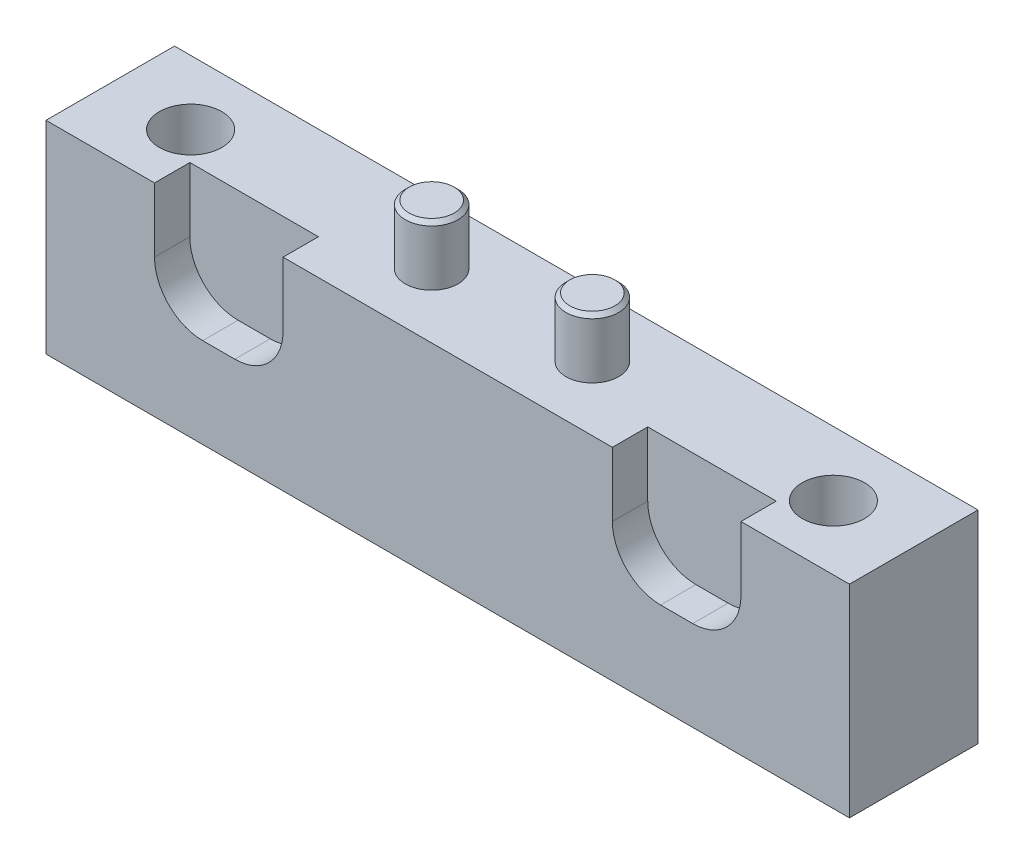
ISO-10303-21;
HEADER;
FILE_DESCRIPTION(('STEP AP214'),'2;1');
FILE_NAME('part.step','',(''),(''),'','','');
FILE_SCHEMA(('AUTOMOTIVE_DESIGN { 1 0 10303 214 1 1 1 1 }'));
ENDSEC;
DATA;
#1=APPLICATION_CONTEXT('core data for automotive mechanical design processes');
#2=APPLICATION_PROTOCOL_DEFINITION('international standard','automotive_design',2000,#1);
#3=PRODUCT_CONTEXT('',#1,'mechanical');
#4=PRODUCT('Part','Part','',(#3));
#5=PRODUCT_RELATED_PRODUCT_CATEGORY('part','',(#4));
#6=PRODUCT_DEFINITION_FORMATION('','',#4);
#7=PRODUCT_DEFINITION_CONTEXT('part definition',#1,'design');
#8=PRODUCT_DEFINITION('design','',#6,#7);
#9=PRODUCT_DEFINITION_SHAPE('','',#8);
#10=(LENGTH_UNIT() NAMED_UNIT(*) SI_UNIT(.MILLI.,.METRE.));
#11=(NAMED_UNIT(*) PLANE_ANGLE_UNIT() SI_UNIT($,.RADIAN.));
#12=(NAMED_UNIT(*) SI_UNIT($,.STERADIAN.) SOLID_ANGLE_UNIT());
#13=UNCERTAINTY_MEASURE_WITH_UNIT(LENGTH_MEASURE(1.E-05),#10,'distance_accuracy_value','');
#14=(GEOMETRIC_REPRESENTATION_CONTEXT(3) GLOBAL_UNCERTAINTY_ASSIGNED_CONTEXT((#13)) GLOBAL_UNIT_ASSIGNED_CONTEXT((#10,
#11,#12)) REPRESENTATION_CONTEXT('',''));
#15=CARTESIAN_POINT('',(0.,0.,0.));
#16=DIRECTION('',(0.,0.,1.));
#17=DIRECTION('',(1.,0.,0.));
#18=AXIS2_PLACEMENT_3D('',#15,#16,#17);
#19=CARTESIAN_POINT('',(-6.35,-15.3416,0.));
#20=DIRECTION('',(0.,1.,0.));
#21=DIRECTION('',(0.5,0.,-0.86602540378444));
#22=AXIS2_PLACEMENT_3D('',#19,#20,#21);
#23=CONICAL_SURFACE('',#22,3.0734,0.785398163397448);
#24=CARTESIAN_POINT('',(-6.35,-14.986,0.));
#25=DIRECTION('',(0.,-1.,0.));
#26=DIRECTION('',(-0.5,0.,0.86602540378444));
#27=AXIS2_PLACEMENT_3D('',#24,#25,#26);
#28=CIRCLE('',#27,3.429);
#29=CARTESIAN_POINT('',(-8.0645,-14.986,2.96960110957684));
#30=VERTEX_POINT('',#29);
#31=EDGE_CURVE('E359',#30,#30,#28,.T.);
#32=ORIENTED_EDGE('',*,*,#31,.T.);
#33=EDGE_LOOP('',(#32));
#34=FACE_BOUND('',#33,.T.);
#35=CARTESIAN_POINT('',(-6.35,-15.3416,0.));
#36=DIRECTION('',(0.,-1.,0.));
#37=DIRECTION('',(-0.5,0.,0.86602540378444));
#38=AXIS2_PLACEMENT_3D('',#35,#36,#37);
#39=CIRCLE('',#38,3.0734);
#40=CARTESIAN_POINT('',(-7.8867,-15.3416,2.66164247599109));
#41=VERTEX_POINT('',#40);
#42=EDGE_CURVE('E362',#41,#41,#39,.T.);
#43=ORIENTED_EDGE('',*,*,#42,.F.);
#44=EDGE_LOOP('',(#43));
#45=FACE_BOUND('',#44,.T.);
#46=ADVANCED_FACE('F16',(#34,#45),#23,.T.);
#47=CARTESIAN_POINT('',(-6.35,-47.0916,0.));
#48=DIRECTION('',(0.,-1.,0.));
#49=DIRECTION('',(-0.5,0.,0.86602540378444));
#50=AXIS2_PLACEMENT_3D('',#47,#48,#49);
#51=CYLINDRICAL_SURFACE('',#50,3.429);
#52=CARTESIAN_POINT('',(-6.35,-11.176,0.));
#53=DIRECTION('',(0.,-1.,0.));
#54=DIRECTION('',(-0.5,0.,0.86602540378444));
#55=AXIS2_PLACEMENT_3D('',#52,#53,#54);
#56=CIRCLE('',#55,3.429);
#57=CARTESIAN_POINT('',(-8.0645,-11.176,2.96960110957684));
#58=VERTEX_POINT('',#57);
#59=EDGE_CURVE('E356',#58,#58,#56,.T.);
#60=ORIENTED_EDGE('',*,*,#59,.T.);
#61=EDGE_LOOP('',(#60));
#62=FACE_BOUND('',#61,.T.);
#63=ORIENTED_EDGE('',*,*,#31,.F.);
#64=EDGE_LOOP('',(#63));
#65=FACE_BOUND('',#64,.T.);
#66=ADVANCED_FACE('F519',(#62,#65),#51,.T.);
#67=CARTESIAN_POINT('',(-6.35,-10.7188,2.06185637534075));
#68=DIRECTION('',(-0.5,0.,0.866025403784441));
#69=DIRECTION('',(0.866025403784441,0.,0.5));
#70=AXIS2_PLACEMENT_3D('',#67,#68,#69);
#71=PLANE('',#70);
#72=DIRECTION('',(-0.866025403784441,0.,-0.5));
#73=VECTOR('',#72,1.);
#74=CARTESIAN_POINT('',(-6.35,-11.176,2.06185637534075));
#75=LINE('',#74,#73);
#76=CARTESIAN_POINT('',(-6.35,-11.176,2.06185637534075));
#77=VERTEX_POINT('',#76);
#78=CARTESIAN_POINT('',(-8.13562,-11.176,1.03092818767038));
#79=VERTEX_POINT('',#78);
#80=EDGE_CURVE('E326',#77,#79,#75,.T.);
#81=ORIENTED_EDGE('',*,*,#80,.F.);
#82=DIRECTION('',(0.,-1.,0.));
#83=VECTOR('',#82,1.);
#84=CARTESIAN_POINT('',(-6.35,-10.7188,2.06185637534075));
#85=LINE('',#84,#83);
#86=CARTESIAN_POINT('',(-6.35,-15.3416,2.06185637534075));
#87=VERTEX_POINT('',#86);
#88=EDGE_CURVE('E345',#77,#87,#85,.T.);
#89=ORIENTED_EDGE('',*,*,#88,.T.);
#90=DIRECTION('',(-0.866025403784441,0.,-0.5));
#91=VECTOR('',#90,1.);
#92=CARTESIAN_POINT('',(-6.35,-15.3416,2.06185637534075));
#93=LINE('',#92,#91);
#94=CARTESIAN_POINT('',(-8.13562,-15.3416,1.03092818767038));
#95=VERTEX_POINT('',#94);
#96=EDGE_CURVE('E341',#87,#95,#93,.T.);
#97=ORIENTED_EDGE('',*,*,#96,.T.);
#98=DIRECTION('',(0.,-1.,0.));
#99=VECTOR('',#98,1.);
#100=CARTESIAN_POINT('',(-8.13562,-10.7188,1.03092818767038));
#101=LINE('',#100,#99);
#102=EDGE_CURVE('E338',#79,#95,#101,.T.);
#103=ORIENTED_EDGE('',*,*,#102,.F.);
#104=EDGE_LOOP('',(#81,#89,#97,#103));
#105=FACE_BOUND('',#104,.T.);
#106=ADVANCED_FACE('F339',(#105),#71,.F.);
#107=CARTESIAN_POINT('',(-6.35,-10.7188,2.06185637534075));
#108=DIRECTION('',(-0.5,0.,-0.866025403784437));
#109=DIRECTION('',(-0.866025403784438,0.,0.5));
#110=AXIS2_PLACEMENT_3D('',#107,#108,#109);
#111=PLANE('',#110);
#112=ORIENTED_EDGE('',*,*,#88,.F.);
#113=DIRECTION('',(0.866025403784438,0.,-0.5));
#114=VECTOR('',#113,1.);
#115=CARTESIAN_POINT('',(-6.35,-11.176,2.06185637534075));
#116=LINE('',#115,#114);
#117=CARTESIAN_POINT('',(-4.56438,-11.176,1.03092818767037));
#118=VERTEX_POINT('',#117);
#119=EDGE_CURVE('E324',#77,#118,#116,.T.);
#120=ORIENTED_EDGE('',*,*,#119,.T.);
#121=DIRECTION('',(0.,-1.,0.));
#122=VECTOR('',#121,1.);
#123=CARTESIAN_POINT('',(-4.56438,-10.7188,1.03092818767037));
#124=LINE('',#123,#122);
#125=CARTESIAN_POINT('',(-4.56438,-15.3416,1.03092818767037));
#126=VERTEX_POINT('',#125);
#127=EDGE_CURVE('E350',#118,#126,#124,.T.);
#128=ORIENTED_EDGE('',*,*,#127,.T.);
#129=DIRECTION('',(0.866025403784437,0.,-0.5));
#130=VECTOR('',#129,1.);
#131=CARTESIAN_POINT('',(-6.35,-15.3416,2.06185637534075));
#132=LINE('',#131,#130);
#133=EDGE_CURVE('E1078',#87,#126,#132,.T.);
#134=ORIENTED_EDGE('',*,*,#133,.F.);
#135=EDGE_LOOP('',(#112,#120,#128,#134));
#136=FACE_BOUND('',#135,.T.);
#137=ADVANCED_FACE('F1008',(#136),#111,.T.);
#138=CARTESIAN_POINT('',(-4.56438,-10.7188,1.03092818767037));
#139=DIRECTION('',(-1.,0.,0.));
#140=DIRECTION('',(0.,0.,1.));
#141=AXIS2_PLACEMENT_3D('',#138,#139,#140);
#142=PLANE('',#141);
#143=ORIENTED_EDGE('',*,*,#127,.F.);
#144=DIRECTION('',(0.,0.,-1.));
#145=VECTOR('',#144,1.);
#146=CARTESIAN_POINT('',(-4.56438,-11.176,1.03092818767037));
#147=LINE('',#146,#145);
#148=CARTESIAN_POINT('',(-4.56438,-11.176,-1.03092818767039));
#149=VERTEX_POINT('',#148);
#150=EDGE_CURVE('E320',#118,#149,#147,.T.);
#151=ORIENTED_EDGE('',*,*,#150,.T.);
#152=DIRECTION('',(0.,-1.,0.));
#153=VECTOR('',#152,1.);
#154=CARTESIAN_POINT('',(-4.56438,-10.7188,-1.03092818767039));
#155=LINE('',#154,#153);
#156=CARTESIAN_POINT('',(-4.56438,-15.3416,-1.03092818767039));
#157=VERTEX_POINT('',#156);
#158=EDGE_CURVE('E1101',#149,#157,#155,.T.);
#159=ORIENTED_EDGE('',*,*,#158,.T.);
#160=DIRECTION('',(0.,0.,-1.));
#161=VECTOR('',#160,1.);
#162=CARTESIAN_POINT('',(-4.56438,-15.3416,1.03092818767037));
#163=LINE('',#162,#161);
#164=EDGE_CURVE('E1117',#126,#157,#163,.T.);
#165=ORIENTED_EDGE('',*,*,#164,.F.);
#166=EDGE_LOOP('',(#143,#151,#159,#165));
#167=FACE_BOUND('',#166,.T.);
#168=ADVANCED_FACE('F997',(#167),#142,.T.);
#169=CARTESIAN_POINT('',(-6.35,-10.7188,-2.06185637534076));
#170=DIRECTION('',(0.5,0.,-0.866025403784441));
#171=DIRECTION('',(-0.866025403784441,0.,-0.5));
#172=AXIS2_PLACEMENT_3D('',#169,#170,#171);
#173=PLANE('',#172);
#174=DIRECTION('',(0.866025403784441,0.,0.5));
#175=VECTOR('',#174,1.);
#176=CARTESIAN_POINT('',(-6.35,-11.176,-2.06185637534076));
#177=LINE('',#176,#175);
#178=CARTESIAN_POINT('',(-6.35,-11.176,-2.06185637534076));
#179=VERTEX_POINT('',#178);
#180=EDGE_CURVE('E317',#179,#149,#177,.T.);
#181=ORIENTED_EDGE('',*,*,#180,.F.);
#182=DIRECTION('',(0.,-1.,0.));
#183=VECTOR('',#182,1.);
#184=CARTESIAN_POINT('',(-6.35,-10.7188,-2.06185637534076));
#185=LINE('',#184,#183);
#186=CARTESIAN_POINT('',(-6.35,-15.3416,-2.06185637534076));
#187=VERTEX_POINT('',#186);
#188=EDGE_CURVE('E1107',#179,#187,#185,.T.);
#189=ORIENTED_EDGE('',*,*,#188,.T.);
#190=DIRECTION('',(0.866025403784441,0.,0.5));
#191=VECTOR('',#190,1.);
#192=CARTESIAN_POINT('',(-6.35,-15.3416,-2.06185637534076));
#193=LINE('',#192,#191);
#194=EDGE_CURVE('E1105',#187,#157,#193,.T.);
#195=ORIENTED_EDGE('',*,*,#194,.T.);
#196=ORIENTED_EDGE('',*,*,#158,.F.);
#197=EDGE_LOOP('',(#181,#189,#195,#196));
#198=FACE_BOUND('',#197,.T.);
#199=ADVANCED_FACE('F534',(#198),#173,.F.);
#200=CARTESIAN_POINT('',(-6.35,-15.3416,0.));
#201=DIRECTION('',(0.,-1.,0.));
#202=DIRECTION('',(-0.5,0.,0.86602540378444));
#203=AXIS2_PLACEMENT_3D('',#200,#201,#202);
#204=PLANE('',#203);
#205=ORIENTED_EDGE('',*,*,#42,.T.);
#206=EDGE_LOOP('',(#205));
#207=FACE_BOUND('',#206,.T.);
#208=DIRECTION('',(0.866025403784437,0.,-0.5));
#209=VECTOR('',#208,1.);
#210=CARTESIAN_POINT('',(-8.13562,-15.3416,-1.03092818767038));
#211=LINE('',#210,#209);
#212=CARTESIAN_POINT('',(-8.13562,-15.3416,-1.03092818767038));
#213=VERTEX_POINT('',#212);
#214=EDGE_CURVE('E1113',#213,#187,#211,.T.);
#215=ORIENTED_EDGE('',*,*,#214,.F.);
#216=DIRECTION('',(0.,0.,1.));
#217=VECTOR('',#216,1.);
#218=CARTESIAN_POINT('',(-8.13562,-15.3416,-1.03092818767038));
#219=LINE('',#218,#217);
#220=EDGE_CURVE('E413',#213,#95,#219,.T.);
#221=ORIENTED_EDGE('',*,*,#220,.T.);
#222=ORIENTED_EDGE('',*,*,#96,.F.);
#223=ORIENTED_EDGE('',*,*,#133,.T.);
#224=ORIENTED_EDGE('',*,*,#164,.T.);
#225=ORIENTED_EDGE('',*,*,#194,.F.);
#226=EDGE_LOOP('',(#215,#221,#222,#223,#224,#225));
#227=FACE_BOUND('',#226,.T.);
#228=ADVANCED_FACE('F531',(#207,#227),#204,.T.);
#229=CARTESIAN_POINT('',(-8.13562,-10.7188,-1.03092818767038));
#230=DIRECTION('',(1.,0.,0.));
#231=DIRECTION('',(0.,0.,-1.));
#232=AXIS2_PLACEMENT_3D('',#229,#230,#231);
#233=PLANE('',#232);
#234=DIRECTION('',(0.,-1.,0.));
#235=VECTOR('',#234,1.);
#236=CARTESIAN_POINT('',(-8.13562,-10.7188,-1.03092818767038));
#237=LINE('',#236,#235);
#238=CARTESIAN_POINT('',(-8.13562,-11.176,-1.03092818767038));
#239=VERTEX_POINT('',#238);
#240=EDGE_CURVE('E1109',#239,#213,#237,.T.);
#241=ORIENTED_EDGE('',*,*,#240,.F.);
#242=DIRECTION('',(0.,0.,1.));
#243=VECTOR('',#242,1.);
#244=CARTESIAN_POINT('',(-8.13562,-11.176,-1.03092818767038));
#245=LINE('',#244,#243);
#246=EDGE_CURVE('E20',#239,#79,#245,.T.);
#247=ORIENTED_EDGE('',*,*,#246,.T.);
#248=ORIENTED_EDGE('',*,*,#102,.T.);
#249=ORIENTED_EDGE('',*,*,#220,.F.);
#250=EDGE_LOOP('',(#241,#247,#248,#249));
#251=FACE_BOUND('',#250,.T.);
#252=ADVANCED_FACE('F509',(#251),#233,.T.);
#253=CARTESIAN_POINT('',(-8.13562,-10.7188,-1.03092818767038));
#254=DIRECTION('',(-0.5,0.,-0.866025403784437));
#255=DIRECTION('',(-0.866025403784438,0.,0.5));
#256=AXIS2_PLACEMENT_3D('',#253,#254,#255);
#257=PLANE('',#256);
#258=DIRECTION('',(0.866025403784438,0.,-0.5));
#259=VECTOR('',#258,1.);
#260=CARTESIAN_POINT('',(-8.13562,-11.176,-1.03092818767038));
#261=LINE('',#260,#259);
#262=EDGE_CURVE('E321',#239,#179,#261,.T.);
#263=ORIENTED_EDGE('',*,*,#262,.F.);
#264=ORIENTED_EDGE('',*,*,#240,.T.);
#265=ORIENTED_EDGE('',*,*,#214,.T.);
#266=ORIENTED_EDGE('',*,*,#188,.F.);
#267=EDGE_LOOP('',(#263,#264,#265,#266));
#268=FACE_BOUND('',#267,.T.);
#269=ADVANCED_FACE('F497',(#268),#257,.F.);
#270=CARTESIAN_POINT('',(-3.8862,-11.176,0.));
#271=DIRECTION('',(0.,1.,0.));
#272=DIRECTION('',(0.,0.,1.));
#273=AXIS2_PLACEMENT_3D('',#270,#271,#272);
#274=PLANE('',#273);
#275=ORIENTED_EDGE('',*,*,#246,.F.);
#276=ORIENTED_EDGE('',*,*,#262,.T.);
#277=ORIENTED_EDGE('',*,*,#180,.T.);
#278=ORIENTED_EDGE('',*,*,#150,.F.);
#279=ORIENTED_EDGE('',*,*,#119,.F.);
#280=ORIENTED_EDGE('',*,*,#80,.T.);
#281=EDGE_LOOP('',(#275,#276,#277,#278,#279,#280));
#282=FACE_BOUND('',#281,.T.);
#283=ADVANCED_FACE('F330',(#282),#274,.F.);
#284=CARTESIAN_POINT('',(8.8138,-11.176,0.));
#285=DIRECTION('',(0.,1.,0.));
#286=DIRECTION('',(0.,0.,1.));
#287=AXIS2_PLACEMENT_3D('',#284,#285,#286);
#288=PLANE('',#287);
#289=DIRECTION('',(0.,0.,1.));
#290=VECTOR('',#289,1.);
#291=CARTESIAN_POINT('',(4.56438,-11.176,-1.03092818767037));
#292=LINE('',#291,#290);
#293=CARTESIAN_POINT('',(4.56438,-11.176,-1.03092818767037));
#294=VERTEX_POINT('',#293);
#295=CARTESIAN_POINT('',(4.56438,-11.176,1.03092818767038));
#296=VERTEX_POINT('',#295);
#297=EDGE_CURVE('E314',#294,#296,#292,.T.);
#298=ORIENTED_EDGE('',*,*,#297,.F.);
#299=DIRECTION('',(0.866025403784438,0.,-0.5));
#300=VECTOR('',#299,1.);
#301=CARTESIAN_POINT('',(4.56438,-11.176,-1.03092818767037));
#302=LINE('',#301,#300);
#303=CARTESIAN_POINT('',(6.35,-11.176,-2.06185637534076));
#304=VERTEX_POINT('',#303);
#305=EDGE_CURVE('E305',#294,#304,#302,.T.);
#306=ORIENTED_EDGE('',*,*,#305,.T.);
#307=DIRECTION('',(0.866025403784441,0.,0.5));
#308=VECTOR('',#307,1.);
#309=CARTESIAN_POINT('',(6.35,-11.176,-2.06185637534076));
#310=LINE('',#309,#308);
#311=CARTESIAN_POINT('',(8.13562,-11.176,-1.03092818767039));
#312=VERTEX_POINT('',#311);
#313=EDGE_CURVE('E302',#304,#312,#310,.T.);
#314=ORIENTED_EDGE('',*,*,#313,.T.);
#315=DIRECTION('',(0.,0.,-1.));
#316=VECTOR('',#315,1.);
#317=CARTESIAN_POINT('',(8.13562,-11.176,1.03092818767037));
#318=LINE('',#317,#316);
#319=CARTESIAN_POINT('',(8.13562,-11.176,1.03092818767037));
#320=VERTEX_POINT('',#319);
#321=EDGE_CURVE('E304',#320,#312,#318,.T.);
#322=ORIENTED_EDGE('',*,*,#321,.F.);
#323=DIRECTION('',(0.866025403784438,0.,-0.5));
#324=VECTOR('',#323,1.);
#325=CARTESIAN_POINT('',(6.35,-11.176,2.06185637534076));
#326=LINE('',#325,#324);
#327=CARTESIAN_POINT('',(6.35,-11.176,2.06185637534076));
#328=VERTEX_POINT('',#327);
#329=EDGE_CURVE('E308',#328,#320,#326,.T.);
#330=ORIENTED_EDGE('',*,*,#329,.F.);
#331=DIRECTION('',(-0.866025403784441,0.,-0.5));
#332=VECTOR('',#331,1.);
#333=CARTESIAN_POINT('',(6.35,-11.176,2.06185637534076));
#334=LINE('',#333,#332);
#335=EDGE_CURVE('E311',#328,#296,#334,.T.);
#336=ORIENTED_EDGE('',*,*,#335,.T.);
#337=EDGE_LOOP('',(#298,#306,#314,#322,#330,#336));
#338=FACE_BOUND('',#337,.T.);
#339=ADVANCED_FACE('F496',(#338),#288,.F.);
#340=CARTESIAN_POINT('',(6.35,-10.7188,-2.06185637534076));
#341=DIRECTION('',(0.5,0.,-0.866025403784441));
#342=DIRECTION('',(-0.866025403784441,0.,-0.5));
#343=AXIS2_PLACEMENT_3D('',#340,#341,#342);
#344=PLANE('',#343);
#345=ORIENTED_EDGE('',*,*,#313,.F.);
#346=DIRECTION('',(0.,-1.,0.));
#347=VECTOR('',#346,1.);
#348=CARTESIAN_POINT('',(6.35,-10.7188,-2.06185637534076));
#349=LINE('',#348,#347);
#350=CARTESIAN_POINT('',(6.35,-15.3416,-2.06185637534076));
#351=VERTEX_POINT('',#350);
#352=EDGE_CURVE('E385',#304,#351,#349,.T.);
#353=ORIENTED_EDGE('',*,*,#352,.T.);
#354=DIRECTION('',(0.866025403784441,0.,0.5));
#355=VECTOR('',#354,1.);
#356=CARTESIAN_POINT('',(6.35,-15.3416,-2.06185637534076));
#357=LINE('',#356,#355);
#358=CARTESIAN_POINT('',(8.13562,-15.3416,-1.03092818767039));
#359=VERTEX_POINT('',#358);
#360=EDGE_CURVE('E377',#351,#359,#357,.T.);
#361=ORIENTED_EDGE('',*,*,#360,.T.);
#362=DIRECTION('',(0.,-1.,0.));
#363=VECTOR('',#362,1.);
#364=CARTESIAN_POINT('',(8.13562,-10.7188,-1.03092818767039));
#365=LINE('',#364,#363);
#366=EDGE_CURVE('E387',#312,#359,#365,.T.);
#367=ORIENTED_EDGE('',*,*,#366,.F.);
#368=EDGE_LOOP('',(#345,#353,#361,#367));
#369=FACE_BOUND('',#368,.T.);
#370=ADVANCED_FACE('F505',(#369),#344,.F.);
#371=CARTESIAN_POINT('',(8.13562,-10.7188,1.03092818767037));
#372=DIRECTION('',(-1.,0.,0.));
#373=DIRECTION('',(0.,0.,1.));
#374=AXIS2_PLACEMENT_3D('',#371,#372,#373);
#375=PLANE('',#374);
#376=DIRECTION('',(0.,-1.,0.));
#377=VECTOR('',#376,1.);
#378=CARTESIAN_POINT('',(8.13562,-10.7188,1.03092818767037));
#379=LINE('',#378,#377);
#380=CARTESIAN_POINT('',(8.13562,-15.3416,1.03092818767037));
#381=VERTEX_POINT('',#380);
#382=EDGE_CURVE('E389',#320,#381,#379,.T.);
#383=ORIENTED_EDGE('',*,*,#382,.F.);
#384=ORIENTED_EDGE('',*,*,#321,.T.);
#385=ORIENTED_EDGE('',*,*,#366,.T.);
#386=DIRECTION('',(0.,0.,-1.));
#387=VECTOR('',#386,1.);
#388=CARTESIAN_POINT('',(8.13562,-15.3416,1.03092818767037));
#389=LINE('',#388,#387);
#390=EDGE_CURVE('E374',#381,#359,#389,.T.);
#391=ORIENTED_EDGE('',*,*,#390,.F.);
#392=EDGE_LOOP('',(#383,#384,#385,#391));
#393=FACE_BOUND('',#392,.T.);
#394=ADVANCED_FACE('F544',(#393),#375,.T.);
#395=CARTESIAN_POINT('',(6.35,-10.7188,2.06185637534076));
#396=DIRECTION('',(-0.5,0.,-0.866025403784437));
#397=DIRECTION('',(-0.866025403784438,0.,0.5));
#398=AXIS2_PLACEMENT_3D('',#395,#396,#397);
#399=PLANE('',#398);
#400=DIRECTION('',(0.,-1.,0.));
#401=VECTOR('',#400,1.);
#402=CARTESIAN_POINT('',(6.35,-10.7188,2.06185637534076));
#403=LINE('',#402,#401);
#404=CARTESIAN_POINT('',(6.35,-15.3416,2.06185637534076));
#405=VERTEX_POINT('',#404);
#406=EDGE_CURVE('E391',#328,#405,#403,.T.);
#407=ORIENTED_EDGE('',*,*,#406,.F.);
#408=ORIENTED_EDGE('',*,*,#329,.T.);
#409=ORIENTED_EDGE('',*,*,#382,.T.);
#410=DIRECTION('',(0.866025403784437,0.,-0.5));
#411=VECTOR('',#410,1.);
#412=CARTESIAN_POINT('',(6.35,-15.3416,2.06185637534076));
#413=LINE('',#412,#411);
#414=EDGE_CURVE('E371',#405,#381,#413,.T.);
#415=ORIENTED_EDGE('',*,*,#414,.F.);
#416=EDGE_LOOP('',(#407,#408,#409,#415));
#417=FACE_BOUND('',#416,.T.);
#418=ADVANCED_FACE('F548',(#417),#399,.T.);
#419=CARTESIAN_POINT('',(6.35,-10.7188,2.06185637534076));
#420=DIRECTION('',(-0.5,0.,0.866025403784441));
#421=DIRECTION('',(0.866025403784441,0.,0.5));
#422=AXIS2_PLACEMENT_3D('',#419,#420,#421);
#423=PLANE('',#422);
#424=ORIENTED_EDGE('',*,*,#335,.F.);
#425=ORIENTED_EDGE('',*,*,#406,.T.);
#426=DIRECTION('',(-0.866025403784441,0.,-0.5));
#427=VECTOR('',#426,1.);
#428=CARTESIAN_POINT('',(6.35,-15.3416,2.06185637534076));
#429=LINE('',#428,#427);
#430=CARTESIAN_POINT('',(4.56438,-15.3416,1.03092818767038));
#431=VERTEX_POINT('',#430);
#432=EDGE_CURVE('E368',#405,#431,#429,.T.);
#433=ORIENTED_EDGE('',*,*,#432,.T.);
#434=DIRECTION('',(0.,-1.,0.));
#435=VECTOR('',#434,1.);
#436=CARTESIAN_POINT('',(4.56438,-10.7188,1.03092818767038));
#437=LINE('',#436,#435);
#438=EDGE_CURVE('E393',#296,#431,#437,.T.);
#439=ORIENTED_EDGE('',*,*,#438,.F.);
#440=EDGE_LOOP('',(#424,#425,#433,#439));
#441=FACE_BOUND('',#440,.T.);
#442=ADVANCED_FACE('F552',(#441),#423,.F.);
#443=CARTESIAN_POINT('',(4.56438,-10.7188,-1.03092818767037));
#444=DIRECTION('',(1.,0.,0.));
#445=DIRECTION('',(0.,0.,-1.));
#446=AXIS2_PLACEMENT_3D('',#443,#444,#445);
#447=PLANE('',#446);
#448=DIRECTION('',(0.,-1.,0.));
#449=VECTOR('',#448,1.);
#450=CARTESIAN_POINT('',(4.56438,-10.7188,-1.03092818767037));
#451=LINE('',#450,#449);
#452=CARTESIAN_POINT('',(4.56438,-15.3416,-1.03092818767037));
#453=VERTEX_POINT('',#452);
#454=EDGE_CURVE('E383',#294,#453,#451,.T.);
#455=ORIENTED_EDGE('',*,*,#454,.F.);
#456=ORIENTED_EDGE('',*,*,#297,.T.);
#457=ORIENTED_EDGE('',*,*,#438,.T.);
#458=DIRECTION('',(0.,0.,1.));
#459=VECTOR('',#458,1.);
#460=CARTESIAN_POINT('',(4.56438,-15.3416,-1.03092818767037));
#461=LINE('',#460,#459);
#462=EDGE_CURVE('E296',#453,#431,#461,.T.);
#463=ORIENTED_EDGE('',*,*,#462,.F.);
#464=EDGE_LOOP('',(#455,#456,#457,#463));
#465=FACE_BOUND('',#464,.T.);
#466=ADVANCED_FACE('F540',(#465),#447,.T.);
#467=CARTESIAN_POINT('',(4.56438,-10.7188,-1.03092818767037));
#468=DIRECTION('',(-0.5,0.,-0.866025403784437));
#469=DIRECTION('',(-0.866025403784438,0.,0.5));
#470=AXIS2_PLACEMENT_3D('',#467,#468,#469);
#471=PLANE('',#470);
#472=ORIENTED_EDGE('',*,*,#305,.F.);
#473=ORIENTED_EDGE('',*,*,#454,.T.);
#474=DIRECTION('',(0.866025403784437,0.,-0.5));
#475=VECTOR('',#474,1.);
#476=CARTESIAN_POINT('',(4.56438,-15.3416,-1.03092818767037));
#477=LINE('',#476,#475);
#478=EDGE_CURVE('E380',#453,#351,#477,.T.);
#479=ORIENTED_EDGE('',*,*,#478,.T.);
#480=ORIENTED_EDGE('',*,*,#352,.F.);
#481=EDGE_LOOP('',(#472,#473,#479,#480));
#482=FACE_BOUND('',#481,.T.);
#483=ADVANCED_FACE('F536',(#482),#471,.F.);
#484=CARTESIAN_POINT('',(6.35,-15.3416,0.));
#485=DIRECTION('',(0.,-1.,0.));
#486=DIRECTION('',(-0.5,0.,0.86602540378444));
#487=AXIS2_PLACEMENT_3D('',#484,#485,#486);
#488=PLANE('',#487);
#489=CARTESIAN_POINT('',(6.35,-15.3416,0.));
#490=DIRECTION('',(0.,-1.,0.));
#491=DIRECTION('',(-0.5,0.,0.86602540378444));
#492=AXIS2_PLACEMENT_3D('',#489,#490,#491);
#493=CIRCLE('',#492,3.0734);
#494=CARTESIAN_POINT('',(4.8133,-15.3416,2.66164247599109));
#495=VERTEX_POINT('',#494);
#496=EDGE_CURVE('E407',#495,#495,#493,.T.);
#497=ORIENTED_EDGE('',*,*,#496,.T.);
#498=EDGE_LOOP('',(#497));
#499=FACE_BOUND('',#498,.T.);
#500=ORIENTED_EDGE('',*,*,#478,.F.);
#501=ORIENTED_EDGE('',*,*,#462,.T.);
#502=ORIENTED_EDGE('',*,*,#432,.F.);
#503=ORIENTED_EDGE('',*,*,#414,.T.);
#504=ORIENTED_EDGE('',*,*,#390,.T.);
#505=ORIENTED_EDGE('',*,*,#360,.F.);
#506=EDGE_LOOP('',(#500,#501,#502,#503,#504,#505));
#507=FACE_BOUND('',#506,.T.);
#508=ADVANCED_FACE('F539',(#499,#507),#488,.T.);
#509=CARTESIAN_POINT('',(6.35,-15.3416,0.));
#510=DIRECTION('',(0.,1.,0.));
#511=DIRECTION('',(0.5,0.,-0.86602540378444));
#512=AXIS2_PLACEMENT_3D('',#509,#510,#511);
#513=CONICAL_SURFACE('',#512,3.0734,0.785398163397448);
#514=CARTESIAN_POINT('',(6.35,-14.986,0.));
#515=DIRECTION('',(0.,-1.,0.));
#516=DIRECTION('',(-0.5,0.,0.86602540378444));
#517=AXIS2_PLACEMENT_3D('',#514,#515,#516);
#518=CIRCLE('',#517,3.429);
#519=CARTESIAN_POINT('',(4.6355,-14.986,2.96960110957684));
#520=VERTEX_POINT('',#519);
#521=EDGE_CURVE('E404',#520,#520,#518,.T.);
#522=ORIENTED_EDGE('',*,*,#521,.T.);
#523=EDGE_LOOP('',(#522));
#524=FACE_BOUND('',#523,.T.);
#525=ORIENTED_EDGE('',*,*,#496,.F.);
#526=EDGE_LOOP('',(#525));
#527=FACE_BOUND('',#526,.T.);
#528=ADVANCED_FACE('F579',(#524,#527),#513,.T.);
#529=CARTESIAN_POINT('',(6.35,-47.0916,0.));
#530=DIRECTION('',(0.,-1.,0.));
#531=DIRECTION('',(-0.5,0.,0.86602540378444));
#532=AXIS2_PLACEMENT_3D('',#529,#530,#531);
#533=CYLINDRICAL_SURFACE('',#532,3.429);
#534=CARTESIAN_POINT('',(6.35,-11.176,0.));
#535=DIRECTION('',(0.,-1.,0.));
#536=DIRECTION('',(-0.5,0.,0.86602540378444));
#537=AXIS2_PLACEMENT_3D('',#534,#535,#536);
#538=CIRCLE('',#537,3.429);
#539=CARTESIAN_POINT('',(4.6355,-11.176,2.96960110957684));
#540=VERTEX_POINT('',#539);
#541=EDGE_CURVE('E401',#540,#540,#538,.T.);
#542=ORIENTED_EDGE('',*,*,#541,.T.);
#543=EDGE_LOOP('',(#542));
#544=FACE_BOUND('',#543,.T.);
#545=ORIENTED_EDGE('',*,*,#521,.F.);
#546=EDGE_LOOP('',(#545));
#547=FACE_BOUND('',#546,.T.);
#548=ADVANCED_FACE('F576',(#544,#547),#533,.T.);
#549=ORIENTED_EDGE('',*,*,#541,.F.);
#550=EDGE_LOOP('',(#549));
#551=FACE_BOUND('',#550,.T.);
#552=CARTESIAN_POINT('',(6.35,-11.176,0.));
#553=DIRECTION('',(0.,-1.,0.));
#554=DIRECTION('',(0.,0.,-1.));
#555=AXIS2_PLACEMENT_3D('',#552,#553,#554);
#556=CIRCLE('',#555,3.96875);
#557=CARTESIAN_POINT('',(6.35,-11.176,-3.96875));
#558=VERTEX_POINT('',#557);
#559=EDGE_CURVE('E414',#558,#558,#556,.T.);
#560=ORIENTED_EDGE('',*,*,#559,.T.);
#561=EDGE_LOOP('',(#560));
#562=FACE_BOUND('',#561,.T.);
#563=ADVANCED_FACE('F508',(#551,#562),#288,.F.);
#564=CARTESIAN_POINT('',(6.35,-16.002,0.));
#565=DIRECTION('',(0.,-1.,0.));
#566=DIRECTION('',(0.,0.,-1.));
#567=AXIS2_PLACEMENT_3D('',#564,#565,#566);
#568=CYLINDRICAL_SURFACE('',#567,3.96875);
#569=ORIENTED_EDGE('',*,*,#559,.F.);
#570=EDGE_LOOP('',(#569));
#571=FACE_BOUND('',#570,.T.);
#572=CARTESIAN_POINT('',(6.35,-16.002,0.));
#573=DIRECTION('',(0.,-1.,0.));
#574=DIRECTION('',(0.,0.,-1.));
#575=AXIS2_PLACEMENT_3D('',#572,#573,#574);
#576=CIRCLE('',#575,3.96875);
#577=CARTESIAN_POINT('',(6.35,-16.002,-3.96875));
#578=VERTEX_POINT('',#577);
#579=EDGE_CURVE('E417',#578,#578,#576,.T.);
#580=ORIENTED_EDGE('',*,*,#579,.T.);
#581=EDGE_LOOP('',(#580));
#582=FACE_BOUND('',#581,.T.);
#583=ADVANCED_FACE('F564',(#571,#582),#568,.F.);
#584=CARTESIAN_POINT('',(4.81020683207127,4.699,-0.889));
#585=DIRECTION('',(0.,1.,0.));
#586=DIRECTION('',(0.5,0.,-0.86602540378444));
#587=AXIS2_PLACEMENT_3D('',#584,#585,#586);
#588=PLANE('',#587);
#589=CARTESIAN_POINT('',(6.35,4.699,0.));
#590=DIRECTION('',(0.,-1.,0.));
#591=DIRECTION('',(-0.5,0.,0.86602540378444));
#592=AXIS2_PLACEMENT_3D('',#589,#590,#591);
#593=CIRCLE('',#592,1.778);
#594=CARTESIAN_POINT('',(5.461,4.699,1.53979316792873));
#595=VERTEX_POINT('',#594);
#596=EDGE_CURVE('E395',#595,#595,#593,.T.);
#597=ORIENTED_EDGE('',*,*,#596,.F.);
#598=EDGE_LOOP('',(#597));
#599=FACE_BOUND('',#598,.T.);
#600=ADVANCED_FACE('F560',(#599),#588,.T.);
#601=CARTESIAN_POINT('',(-19.364325,-5.08,2.286));
#602=DIRECTION('',(0.,0.,1.));
#603=DIRECTION('',(1.,0.,0.));
#604=AXIS2_PLACEMENT_3D('',#601,#602,#603);
#605=CYLINDRICAL_SURFACE('',#604,3.81);
#606=CARTESIAN_POINT('',(-19.364325,-5.08,5.08));
#607=DIRECTION('',(0.,0.,1.));
#608=DIRECTION('',(1.,0.,0.));
#609=AXIS2_PLACEMENT_3D('',#606,#607,#608);
#610=CIRCLE('',#609,3.81);
#611=CARTESIAN_POINT('',(-23.174325,-5.08,5.08));
#612=VERTEX_POINT('',#611);
#613=CARTESIAN_POINT('',(-19.364325,-8.89,5.08));
#614=VERTEX_POINT('',#613);
#615=EDGE_CURVE('E250',#612,#614,#610,.T.);
#616=ORIENTED_EDGE('',*,*,#615,.T.);
#617=DIRECTION('',(0.,0.,1.));
#618=VECTOR('',#617,1.);
#619=CARTESIAN_POINT('',(-19.364325,-8.89,2.286));
#620=LINE('',#619,#618);
#621=CARTESIAN_POINT('',(-19.364325,-8.89,2.286));
#622=VERTEX_POINT('',#621);
#623=EDGE_CURVE('E263',#622,#614,#620,.T.);
#624=ORIENTED_EDGE('',*,*,#623,.F.);
#625=CARTESIAN_POINT('',(-19.364325,-5.08,2.286));
#626=DIRECTION('',(0.,0.,1.));
#627=DIRECTION('',(1.,0.,0.));
#628=AXIS2_PLACEMENT_3D('',#625,#626,#627);
#629=CIRCLE('',#628,3.81);
#630=CARTESIAN_POINT('',(-23.174325,-5.08,2.286));
#631=VERTEX_POINT('',#630);
#632=EDGE_CURVE('E236',#631,#622,#629,.T.);
#633=ORIENTED_EDGE('',*,*,#632,.F.);
#634=DIRECTION('',(0.,0.,1.));
#635=VECTOR('',#634,1.);
#636=CARTESIAN_POINT('',(-23.174325,-5.08,2.286));
#637=LINE('',#636,#635);
#638=EDGE_CURVE('E265',#631,#612,#637,.T.);
#639=ORIENTED_EDGE('',*,*,#638,.T.);
#640=EDGE_LOOP('',(#616,#624,#633,#639));
#641=FACE_BOUND('',#640,.T.);
#642=ADVANCED_FACE('F563',(#641),#605,.F.);
#643=CARTESIAN_POINT('',(-19.364325,-8.89,2.286));
#644=DIRECTION('',(0.,-1.,0.));
#645=DIRECTION('',(0.,0.,-1.));
#646=AXIS2_PLACEMENT_3D('',#643,#644,#645);
#647=PLANE('',#646);
#648=DIRECTION('',(1.,0.,0.));
#649=VECTOR('',#648,1.);
#650=CARTESIAN_POINT('',(-19.364325,-8.89,5.08));
#651=LINE('',#650,#649);
#652=CARTESIAN_POINT('',(-16.824325,-8.89,5.08));
#653=VERTEX_POINT('',#652);
#654=EDGE_CURVE('E253',#614,#653,#651,.T.);
#655=ORIENTED_EDGE('',*,*,#654,.T.);
#656=DIRECTION('',(0.,0.,1.));
#657=VECTOR('',#656,1.);
#658=CARTESIAN_POINT('',(-16.824325,-8.89,2.286));
#659=LINE('',#658,#657);
#660=CARTESIAN_POINT('',(-16.824325,-8.89,2.286));
#661=VERTEX_POINT('',#660);
#662=EDGE_CURVE('E261',#661,#653,#659,.T.);
#663=ORIENTED_EDGE('',*,*,#662,.F.);
#664=DIRECTION('',(1.,0.,0.));
#665=VECTOR('',#664,1.);
#666=CARTESIAN_POINT('',(-19.364325,-8.89,2.286));
#667=LINE('',#666,#665);
#668=EDGE_CURVE('E239',#622,#661,#667,.T.);
#669=ORIENTED_EDGE('',*,*,#668,.F.);
#670=ORIENTED_EDGE('',*,*,#623,.T.);
#671=EDGE_LOOP('',(#655,#663,#669,#670));
#672=FACE_BOUND('',#671,.T.);
#673=ADVANCED_FACE('F642',(#672),#647,.F.);
#674=CARTESIAN_POINT('',(-16.824325,-5.08,2.286));
#675=DIRECTION('',(0.,0.,1.));
#676=DIRECTION('',(1.,0.,0.));
#677=AXIS2_PLACEMENT_3D('',#674,#675,#676);
#678=CYLINDRICAL_SURFACE('',#677,3.81);
#679=CARTESIAN_POINT('',(-16.824325,-5.08,5.08));
#680=DIRECTION('',(0.,0.,1.));
#681=DIRECTION('',(1.,0.,0.));
#682=AXIS2_PLACEMENT_3D('',#679,#680,#681);
#683=CIRCLE('',#682,3.81);
#684=CARTESIAN_POINT('',(-13.014325,-5.08,5.08));
#685=VERTEX_POINT('',#684);
#686=EDGE_CURVE('E230',#653,#685,#683,.T.);
#687=ORIENTED_EDGE('',*,*,#686,.T.);
#688=DIRECTION('',(0.,0.,1.));
#689=VECTOR('',#688,1.);
#690=CARTESIAN_POINT('',(-13.014325,-5.08,2.286));
#691=LINE('',#690,#689);
#692=CARTESIAN_POINT('',(-13.014325,-5.08,2.286));
#693=VERTEX_POINT('',#692);
#694=EDGE_CURVE('E258',#693,#685,#691,.T.);
#695=ORIENTED_EDGE('',*,*,#694,.F.);
#696=CARTESIAN_POINT('',(-16.824325,-5.08,2.286));
#697=DIRECTION('',(0.,0.,1.));
#698=DIRECTION('',(1.,0.,0.));
#699=AXIS2_PLACEMENT_3D('',#696,#697,#698);
#700=CIRCLE('',#699,3.81);
#701=EDGE_CURVE('E242',#661,#693,#700,.T.);
#702=ORIENTED_EDGE('',*,*,#701,.F.);
#703=ORIENTED_EDGE('',*,*,#662,.T.);
#704=EDGE_LOOP('',(#687,#695,#702,#703));
#705=FACE_BOUND('',#704,.T.);
#706=ADVANCED_FACE('F629',(#705),#678,.F.);
#707=CARTESIAN_POINT('',(19.364325,-8.89,2.286));
#708=DIRECTION('',(0.,-1.,0.));
#709=DIRECTION('',(1.,0.,0.));
#710=AXIS2_PLACEMENT_3D('',#707,#708,#709);
#711=PLANE('',#710);
#712=DIRECTION('',(1.,0.,0.));
#713=VECTOR('',#712,1.);
#714=CARTESIAN_POINT('',(19.364325,-8.89,5.08));
#715=LINE('',#714,#713);
#716=CARTESIAN_POINT('',(16.824325,-8.89,5.08));
#717=VERTEX_POINT('',#716);
#718=CARTESIAN_POINT('',(19.364325,-8.89,5.08));
#719=VERTEX_POINT('',#718);
#720=EDGE_CURVE('E214',#717,#719,#715,.T.);
#721=ORIENTED_EDGE('',*,*,#720,.T.);
#722=DIRECTION('',(0.,0.,1.));
#723=VECTOR('',#722,1.);
#724=CARTESIAN_POINT('',(19.364325,-8.89,2.286));
#725=LINE('',#724,#723);
#726=CARTESIAN_POINT('',(19.364325,-8.89,2.286));
#727=VERTEX_POINT('',#726);
#728=EDGE_CURVE('E182',#727,#719,#725,.T.);
#729=ORIENTED_EDGE('',*,*,#728,.F.);
#730=DIRECTION('',(1.,0.,0.));
#731=VECTOR('',#730,1.);
#732=CARTESIAN_POINT('',(19.364325,-8.89,2.286));
#733=LINE('',#732,#731);
#734=CARTESIAN_POINT('',(16.824325,-8.89,2.286));
#735=VERTEX_POINT('',#734);
#736=EDGE_CURVE('E197',#735,#727,#733,.T.);
#737=ORIENTED_EDGE('',*,*,#736,.F.);
#738=DIRECTION('',(0.,0.,1.));
#739=VECTOR('',#738,1.);
#740=CARTESIAN_POINT('',(16.824325,-8.89,2.286));
#741=LINE('',#740,#739);
#742=EDGE_CURVE('E219',#735,#717,#741,.T.);
#743=ORIENTED_EDGE('',*,*,#742,.T.);
#744=EDGE_LOOP('',(#721,#729,#737,#743));
#745=FACE_BOUND('',#744,.T.);
#746=ADVANCED_FACE('F453',(#745),#711,.F.);
#747=CARTESIAN_POINT('',(19.364325,-5.08,2.286));
#748=DIRECTION('',(0.,0.,1.));
#749=DIRECTION('',(1.,0.,0.));
#750=AXIS2_PLACEMENT_3D('',#747,#748,#749);
#751=CYLINDRICAL_SURFACE('',#750,3.81);
#752=CARTESIAN_POINT('',(19.364325,-5.08,5.08));
#753=DIRECTION('',(0.,0.,1.));
#754=DIRECTION('',(1.,0.,0.));
#755=AXIS2_PLACEMENT_3D('',#752,#753,#754);
#756=CIRCLE('',#755,3.81);
#757=CARTESIAN_POINT('',(23.174325,-5.08,5.08));
#758=VERTEX_POINT('',#757);
#759=EDGE_CURVE('E176',#719,#758,#756,.T.);
#760=ORIENTED_EDGE('',*,*,#759,.T.);
#761=DIRECTION('',(0.,0.,1.));
#762=VECTOR('',#761,1.);
#763=CARTESIAN_POINT('',(23.174325,-5.08,2.286));
#764=LINE('',#763,#762);
#765=CARTESIAN_POINT('',(23.174325,-5.08,2.286));
#766=VERTEX_POINT('',#765);
#767=EDGE_CURVE('E180',#766,#758,#764,.T.);
#768=ORIENTED_EDGE('',*,*,#767,.F.);
#769=CARTESIAN_POINT('',(19.364325,-5.08,2.286));
#770=DIRECTION('',(0.,0.,1.));
#771=DIRECTION('',(1.,0.,0.));
#772=AXIS2_PLACEMENT_3D('',#769,#770,#771);
#773=CIRCLE('',#772,3.81);
#774=EDGE_CURVE('E216',#727,#766,#773,.T.);
#775=ORIENTED_EDGE('',*,*,#774,.F.);
#776=ORIENTED_EDGE('',*,*,#728,.T.);
#777=EDGE_LOOP('',(#760,#768,#775,#776));
#778=FACE_BOUND('',#777,.T.);
#779=ADVANCED_FACE('F178',(#778),#751,.F.);
#780=CARTESIAN_POINT('',(16.824325,-5.08,2.286));
#781=DIRECTION('',(0.,0.,1.));
#782=DIRECTION('',(1.,0.,0.));
#783=AXIS2_PLACEMENT_3D('',#780,#781,#782);
#784=CYLINDRICAL_SURFACE('',#783,3.81);
#785=CARTESIAN_POINT('',(16.824325,-5.08,5.08));
#786=DIRECTION('',(0.,0.,1.));
#787=DIRECTION('',(1.,0.,0.));
#788=AXIS2_PLACEMENT_3D('',#785,#786,#787);
#789=CIRCLE('',#788,3.81);
#790=CARTESIAN_POINT('',(13.014325,-5.08,5.08));
#791=VERTEX_POINT('',#790);
#792=EDGE_CURVE('E208',#791,#717,#789,.T.);
#793=ORIENTED_EDGE('',*,*,#792,.T.);
#794=ORIENTED_EDGE('',*,*,#742,.F.);
#795=CARTESIAN_POINT('',(16.824325,-5.08,2.286));
#796=DIRECTION('',(0.,0.,1.));
#797=DIRECTION('',(1.,0.,0.));
#798=AXIS2_PLACEMENT_3D('',#795,#796,#797);
#799=CIRCLE('',#798,3.81);
#800=CARTESIAN_POINT('',(13.014325,-5.08,2.286));
#801=VERTEX_POINT('',#800);
#802=EDGE_CURVE('E445',#801,#735,#799,.T.);
#803=ORIENTED_EDGE('',*,*,#802,.F.);
#804=DIRECTION('',(0.,0.,1.));
#805=VECTOR('',#804,1.);
#806=CARTESIAN_POINT('',(13.014325,-5.08,2.286));
#807=LINE('',#806,#805);
#808=EDGE_CURVE('E221',#801,#791,#807,.T.);
#809=ORIENTED_EDGE('',*,*,#808,.T.);
#810=EDGE_LOOP('',(#793,#794,#803,#809));
#811=FACE_BOUND('',#810,.T.);
#812=ADVANCED_FACE('F457',(#811),#784,.F.);
#813=CARTESIAN_POINT('',(-31.75,-16.002,-5.08));
#814=DIRECTION('',(0.,-1.,0.));
#815=DIRECTION('',(1.,0.,0.));
#816=AXIS2_PLACEMENT_3D('',#813,#814,#815);
#817=PLANE('',#816);
#818=ORIENTED_EDGE('',*,*,#579,.F.);
#819=EDGE_LOOP('',(#818));
#820=FACE_BOUND('',#819,.T.);
#821=CARTESIAN_POINT('',(-6.35,-16.002,0.));
#822=DIRECTION('',(0.,-1.,0.));
#823=DIRECTION('',(0.,0.,-1.));
#824=AXIS2_PLACEMENT_3D('',#821,#822,#823);
#825=CIRCLE('',#824,3.96875);
#826=CARTESIAN_POINT('',(-6.35,-16.002,-3.96875));
#827=VERTEX_POINT('',#826);
#828=EDGE_CURVE('E423',#827,#827,#825,.T.);
#829=ORIENTED_EDGE('',*,*,#828,.F.);
#830=EDGE_LOOP('',(#829));
#831=FACE_BOUND('',#830,.T.);
#832=CARTESIAN_POINT('',(25.4,-16.002,0.));
#833=DIRECTION('',(0.,1.,0.));
#834=DIRECTION('',(0.,0.,1.));
#835=AXIS2_PLACEMENT_3D('',#832,#833,#834);
#836=CIRCLE('',#835,2.4638);
#837=CARTESIAN_POINT('',(25.4,-16.002,2.4638));
#838=VERTEX_POINT('',#837);
#839=EDGE_CURVE('E426',#838,#838,#836,.T.);
#840=ORIENTED_EDGE('',*,*,#839,.T.);
#841=EDGE_LOOP('',(#840));
#842=FACE_BOUND('',#841,.T.);
#843=DIRECTION('',(1.,0.,0.));
#844=VECTOR('',#843,1.);
#845=CARTESIAN_POINT('',(-31.75,-16.002,5.08));
#846=LINE('',#845,#844);
#847=CARTESIAN_POINT('',(-31.75,-16.002,5.08));
#848=VERTEX_POINT('',#847);
#849=CARTESIAN_POINT('',(31.75,-16.002,5.08));
#850=VERTEX_POINT('',#849);
#851=EDGE_CURVE('E285',#848,#850,#846,.T.);
#852=ORIENTED_EDGE('',*,*,#851,.F.);
#853=DIRECTION('',(0.,0.,1.));
#854=VECTOR('',#853,1.);
#855=CARTESIAN_POINT('',(-31.75,-16.002,-5.08));
#856=LINE('',#855,#854);
#857=CARTESIAN_POINT('',(-31.75,-16.002,-5.08));
#858=VERTEX_POINT('',#857);
#859=EDGE_CURVE('E282',#858,#848,#856,.T.);
#860=ORIENTED_EDGE('',*,*,#859,.F.);
#861=DIRECTION('',(1.,0.,0.));
#862=VECTOR('',#861,1.);
#863=CARTESIAN_POINT('',(-31.75,-16.002,-5.08));
#864=LINE('',#863,#862);
#865=CARTESIAN_POINT('',(31.75,-16.002,-5.08));
#866=VERTEX_POINT('',#865);
#867=EDGE_CURVE('E273',#858,#866,#864,.T.);
#868=ORIENTED_EDGE('',*,*,#867,.T.);
#869=DIRECTION('',(0.,0.,1.));
#870=VECTOR('',#869,1.);
#871=CARTESIAN_POINT('',(31.75,-16.002,-5.08));
#872=LINE('',#871,#870);
#873=EDGE_CURVE('E299',#866,#850,#872,.T.);
#874=ORIENTED_EDGE('',*,*,#873,.T.);
#875=EDGE_LOOP('',(#852,#860,#868,#874));
#876=FACE_BOUND('',#875,.T.);
#877=CARTESIAN_POINT('',(-25.4,-16.002,0.));
#878=DIRECTION('',(0.,1.,0.));
#879=DIRECTION('',(0.,0.,1.));
#880=AXIS2_PLACEMENT_3D('',#877,#878,#879);
#881=CIRCLE('',#880,2.4638);
#882=CARTESIAN_POINT('',(-25.4,-16.002,2.4638));
#883=VERTEX_POINT('',#882);
#884=EDGE_CURVE('E432',#883,#883,#881,.T.);
#885=ORIENTED_EDGE('',*,*,#884,.T.);
#886=EDGE_LOOP('',(#885));
#887=FACE_BOUND('',#886,.T.);
#888=ADVANCED_FACE('F475',(#820,#831,#842,#876,#887),#817,.T.);
#889=CARTESIAN_POINT('',(6.35,4.699,0.));
#890=DIRECTION('',(0.,-1.,0.));
#891=DIRECTION('',(-0.5,0.,0.86602540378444));
#892=AXIS2_PLACEMENT_3D('',#889,#890,#891);
#893=CONICAL_SURFACE('',#892,1.778,0.785398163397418);
#894=CARTESIAN_POINT('',(6.35,4.3942,0.));
#895=DIRECTION('',(0.,-1.,0.));
#896=DIRECTION('',(-0.5,0.,0.86602540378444));
#897=AXIS2_PLACEMENT_3D('',#894,#895,#896);
#898=CIRCLE('',#897,2.0828);
#899=CARTESIAN_POINT('',(5.3086,4.3942,1.80375771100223));
#900=VERTEX_POINT('',#899);
#901=EDGE_CURVE('E398',#900,#900,#898,.T.);
#902=ORIENTED_EDGE('',*,*,#901,.F.);
#903=EDGE_LOOP('',(#902));
#904=FACE_BOUND('',#903,.T.);
#905=ORIENTED_EDGE('',*,*,#596,.T.);
#906=EDGE_LOOP('',(#905));
#907=FACE_BOUND('',#906,.T.);
#908=ADVANCED_FACE('F566',(#904,#907),#893,.T.);
#909=CARTESIAN_POINT('',(-13.014325,0.,2.286));
#910=DIRECTION('',(1.,0.,0.));
#911=DIRECTION('',(0.,1.,0.));
#912=AXIS2_PLACEMENT_3D('',#909,#910,#911);
#913=PLANE('',#912);
#914=DIRECTION('',(0.,1.,0.));
#915=VECTOR('',#914,1.);
#916=CARTESIAN_POINT('',(-13.014325,0.,5.08));
#917=LINE('',#916,#915);
#918=CARTESIAN_POINT('',(-13.014325,0.,5.08));
#919=VERTEX_POINT('',#918);
#920=EDGE_CURVE('E218',#685,#919,#917,.T.);
#921=ORIENTED_EDGE('',*,*,#920,.T.);
#922=DIRECTION('',(0.,0.,1.));
#923=VECTOR('',#922,1.);
#924=CARTESIAN_POINT('',(-13.014325,0.,2.286));
#925=LINE('',#924,#923);
#926=CARTESIAN_POINT('',(-13.014325,0.,2.286));
#927=VERTEX_POINT('',#926);
#928=EDGE_CURVE('E245',#927,#919,#925,.T.);
#929=ORIENTED_EDGE('',*,*,#928,.F.);
#930=DIRECTION('',(0.,1.,0.));
#931=VECTOR('',#930,1.);
#932=CARTESIAN_POINT('',(-13.014325,0.,2.286));
#933=LINE('',#932,#931);
#934=EDGE_CURVE('E226',#693,#927,#933,.T.);
#935=ORIENTED_EDGE('',*,*,#934,.F.);
#936=ORIENTED_EDGE('',*,*,#694,.T.);
#937=EDGE_LOOP('',(#921,#929,#935,#936));
#938=FACE_BOUND('',#937,.T.);
#939=ADVANCED_FACE('F569',(#938),#913,.F.);
#940=CARTESIAN_POINT('',(-16.824325,-5.08,2.286));
#941=DIRECTION('',(0.,0.,1.));
#942=DIRECTION('',(1.,0.,0.));
#943=AXIS2_PLACEMENT_3D('',#940,#941,#942);
#944=PLANE('',#943);
#945=ORIENTED_EDGE('',*,*,#934,.T.);
#946=DIRECTION('',(-1.,0.,0.));
#947=VECTOR('',#946,1.);
#948=CARTESIAN_POINT('',(-13.014325,0.,2.286));
#949=LINE('',#948,#947);
#950=CARTESIAN_POINT('',(-23.174325,0.,2.286));
#951=VERTEX_POINT('',#950);
#952=EDGE_CURVE('E229',#927,#951,#949,.T.);
#953=ORIENTED_EDGE('',*,*,#952,.T.);
#954=DIRECTION('',(0.,-1.,0.));
#955=VECTOR('',#954,1.);
#956=CARTESIAN_POINT('',(-23.174325,-5.08,2.286));
#957=LINE('',#956,#955);
#958=EDGE_CURVE('E233',#951,#631,#957,.T.);
#959=ORIENTED_EDGE('',*,*,#958,.T.);
#960=ORIENTED_EDGE('',*,*,#632,.T.);
#961=ORIENTED_EDGE('',*,*,#668,.T.);
#962=ORIENTED_EDGE('',*,*,#701,.T.);
#963=EDGE_LOOP('',(#945,#953,#959,#960,#961,#962));
#964=FACE_BOUND('',#963,.T.);
#965=ADVANCED_FACE('F636',(#964),#944,.T.);
#966=CARTESIAN_POINT('',(-23.174325,-5.08,2.286));
#967=DIRECTION('',(-1.,0.,0.));
#968=DIRECTION('',(0.,0.,1.));
#969=AXIS2_PLACEMENT_3D('',#966,#967,#968);
#970=PLANE('',#969);
#971=DIRECTION('',(0.,-1.,0.));
#972=VECTOR('',#971,1.);
#973=CARTESIAN_POINT('',(-23.174325,-5.08,5.08));
#974=LINE('',#973,#972);
#975=CARTESIAN_POINT('',(-23.174325,0.,5.08));
#976=VERTEX_POINT('',#975);
#977=EDGE_CURVE('E248',#976,#612,#974,.T.);
#978=ORIENTED_EDGE('',*,*,#977,.T.);
#979=ORIENTED_EDGE('',*,*,#638,.F.);
#980=ORIENTED_EDGE('',*,*,#958,.F.);
#981=DIRECTION('',(0.,0.,1.));
#982=VECTOR('',#981,1.);
#983=CARTESIAN_POINT('',(-23.174325,0.,2.286));
#984=LINE('',#983,#982);
#985=EDGE_CURVE('E171',#951,#976,#984,.T.);
#986=ORIENTED_EDGE('',*,*,#985,.T.);
#987=EDGE_LOOP('',(#978,#979,#980,#986));
#988=FACE_BOUND('',#987,.T.);
#989=ADVANCED_FACE('F492',(#988),#970,.F.);
#990=CARTESIAN_POINT('',(-31.75,0.,-5.08));
#991=DIRECTION('',(-1.,0.,0.));
#992=DIRECTION('',(0.,0.,1.));
#993=AXIS2_PLACEMENT_3D('',#990,#991,#992);
#994=PLANE('',#993);
#995=DIRECTION('',(0.,-1.,0.));
#996=VECTOR('',#995,1.);
#997=CARTESIAN_POINT('',(-31.75,0.,5.08));
#998=LINE('',#997,#996);
#999=CARTESIAN_POINT('',(-31.75,0.,5.08));
#1000=VERTEX_POINT('',#999);
#1001=EDGE_CURVE('E260',#1000,#848,#998,.T.);
#1002=ORIENTED_EDGE('',*,*,#1001,.F.);
#1003=DIRECTION('',(0.,0.,1.));
#1004=VECTOR('',#1003,1.);
#1005=CARTESIAN_POINT('',(-31.75,0.,-5.08));
#1006=LINE('',#1005,#1004);
#1007=CARTESIAN_POINT('',(-31.75,0.,-5.08));
#1008=VERTEX_POINT('',#1007);
#1009=EDGE_CURVE('E293',#1008,#1000,#1006,.T.);
#1010=ORIENTED_EDGE('',*,*,#1009,.F.);
#1011=DIRECTION('',(0.,-1.,0.));
#1012=VECTOR('',#1011,1.);
#1013=CARTESIAN_POINT('',(-31.75,0.,-5.08));
#1014=LINE('',#1013,#1012);
#1015=EDGE_CURVE('E270',#1008,#858,#1014,.T.);
#1016=ORIENTED_EDGE('',*,*,#1015,.T.);
#1017=ORIENTED_EDGE('',*,*,#859,.T.);
#1018=EDGE_LOOP('',(#1002,#1010,#1016,#1017));
#1019=FACE_BOUND('',#1018,.T.);
#1020=ADVANCED_FACE('F18',(#1019),#994,.T.);
#1021=CARTESIAN_POINT('',(-31.75,-16.002,-5.08));
#1022=DIRECTION('',(0.,0.,1.));
#1023=DIRECTION('',(1.,0.,0.));
#1024=AXIS2_PLACEMENT_3D('',#1021,#1022,#1023);
#1025=PLANE('',#1024);
#1026=ORIENTED_EDGE('',*,*,#1015,.F.);
#1027=DIRECTION('',(-1.,0.,0.));
#1028=VECTOR('',#1027,1.);
#1029=CARTESIAN_POINT('',(-31.75,0.,-5.08));
#1030=LINE('',#1029,#1028);
#1031=CARTESIAN_POINT('',(31.75,0.,-5.08));
#1032=VERTEX_POINT('',#1031);
#1033=EDGE_CURVE('E279',#1032,#1008,#1030,.T.);
#1034=ORIENTED_EDGE('',*,*,#1033,.F.);
#1035=DIRECTION('',(0.,1.,0.));
#1036=VECTOR('',#1035,1.);
#1037=CARTESIAN_POINT('',(31.75,0.,-5.08));
#1038=LINE('',#1037,#1036);
#1039=EDGE_CURVE('E276',#866,#1032,#1038,.T.);
#1040=ORIENTED_EDGE('',*,*,#1039,.F.);
#1041=ORIENTED_EDGE('',*,*,#867,.F.);
#1042=EDGE_LOOP('',(#1026,#1034,#1040,#1041));
#1043=FACE_BOUND('',#1042,.T.);
#1044=ADVANCED_FACE('F482',(#1043),#1025,.F.);
#1045=CARTESIAN_POINT('',(31.75,0.,-5.08));
#1046=DIRECTION('',(1.,0.,0.));
#1047=DIRECTION('',(0.,0.,-1.));
#1048=AXIS2_PLACEMENT_3D('',#1045,#1046,#1047);
#1049=PLANE('',#1048);
#1050=DIRECTION('',(0.,1.,0.));
#1051=VECTOR('',#1050,1.);
#1052=CARTESIAN_POINT('',(31.75,0.,5.08));
#1053=LINE('',#1052,#1051);
#1054=CARTESIAN_POINT('',(31.75,0.,5.08));
#1055=VERTEX_POINT('',#1054);
#1056=EDGE_CURVE('E288',#850,#1055,#1053,.T.);
#1057=ORIENTED_EDGE('',*,*,#1056,.F.);
#1058=ORIENTED_EDGE('',*,*,#873,.F.);
#1059=ORIENTED_EDGE('',*,*,#1039,.T.);
#1060=DIRECTION('',(0.,0.,1.));
#1061=VECTOR('',#1060,1.);
#1062=CARTESIAN_POINT('',(31.75,0.,-5.08));
#1063=LINE('',#1062,#1061);
#1064=EDGE_CURVE('E297',#1032,#1055,#1063,.T.);
#1065=ORIENTED_EDGE('',*,*,#1064,.T.);
#1066=EDGE_LOOP('',(#1057,#1058,#1059,#1065));
#1067=FACE_BOUND('',#1066,.T.);
#1068=ADVANCED_FACE('F480',(#1067),#1049,.T.);
#1069=CARTESIAN_POINT('',(-31.75,-16.002,5.08));
#1070=DIRECTION('',(0.,0.,1.));
#1071=DIRECTION('',(1.,0.,0.));
#1072=AXIS2_PLACEMENT_3D('',#1069,#1070,#1071);
#1073=PLANE('',#1072);
#1074=DIRECTION('',(0.,-1.,0.));
#1075=VECTOR('',#1074,1.);
#1076=CARTESIAN_POINT('',(13.014325,0.,5.08));
#1077=LINE('',#1076,#1075);
#1078=CARTESIAN_POINT('',(13.014325,0.,5.08));
#1079=VERTEX_POINT('',#1078);
#1080=EDGE_CURVE('E205',#1079,#791,#1077,.T.);
#1081=ORIENTED_EDGE('',*,*,#1080,.F.);
#1082=DIRECTION('',(-1.,0.,0.));
#1083=VECTOR('',#1082,1.);
#1084=CARTESIAN_POINT('',(-31.75,0.,5.08));
#1085=LINE('',#1084,#1083);
#1086=EDGE_CURVE('E292',#1079,#919,#1085,.T.);
#1087=ORIENTED_EDGE('',*,*,#1086,.T.);
#1088=ORIENTED_EDGE('',*,*,#920,.F.);
#1089=ORIENTED_EDGE('',*,*,#686,.F.);
#1090=ORIENTED_EDGE('',*,*,#654,.F.);
#1091=ORIENTED_EDGE('',*,*,#615,.F.);
#1092=ORIENTED_EDGE('',*,*,#977,.F.);
#1093=EDGE_CURVE('E290',#976,#1000,#1085,.T.);
#1094=ORIENTED_EDGE('',*,*,#1093,.T.);
#1095=ORIENTED_EDGE('',*,*,#1001,.T.);
#1096=ORIENTED_EDGE('',*,*,#851,.T.);
#1097=ORIENTED_EDGE('',*,*,#1056,.T.);
#1098=CARTESIAN_POINT('',(23.174325,0.,5.08));
#1099=VERTEX_POINT('',#1098);
#1100=EDGE_CURVE('E204',#1055,#1099,#1085,.T.);
#1101=ORIENTED_EDGE('',*,*,#1100,.T.);
#1102=DIRECTION('',(0.,1.,0.));
#1103=VECTOR('',#1102,1.);
#1104=CARTESIAN_POINT('',(23.174325,-5.08,5.08));
#1105=LINE('',#1104,#1103);
#1106=EDGE_CURVE('E187',#758,#1099,#1105,.T.);
#1107=ORIENTED_EDGE('',*,*,#1106,.F.);
#1108=ORIENTED_EDGE('',*,*,#759,.F.);
#1109=ORIENTED_EDGE('',*,*,#720,.F.);
#1110=ORIENTED_EDGE('',*,*,#792,.F.);
#1111=EDGE_LOOP('',(#1081,#1087,#1088,#1089,#1090,#1091,#1092,#1094,#1095,#1096,#1097,#1101,
#1107,#1108,#1109,#1110));
#1112=FACE_BOUND('',#1111,.T.);
#1113=ADVANCED_FACE('F201',(#1112),#1073,.T.);
#1114=CARTESIAN_POINT('',(23.174325,-5.08,2.286));
#1115=DIRECTION('',(1.,0.,0.));
#1116=DIRECTION('',(0.,0.,-1.));
#1117=AXIS2_PLACEMENT_3D('',#1114,#1115,#1116);
#1118=PLANE('',#1117);
#1119=ORIENTED_EDGE('',*,*,#1106,.T.);
#1120=DIRECTION('',(0.,0.,1.));
#1121=VECTOR('',#1120,1.);
#1122=CARTESIAN_POINT('',(23.174325,0.,2.286));
#1123=LINE('',#1122,#1121);
#1124=CARTESIAN_POINT('',(23.174325,0.,2.286));
#1125=VERTEX_POINT('',#1124);
#1126=EDGE_CURVE('E196',#1125,#1099,#1123,.T.);
#1127=ORIENTED_EDGE('',*,*,#1126,.F.);
#1128=DIRECTION('',(0.,1.,0.));
#1129=VECTOR('',#1128,1.);
#1130=CARTESIAN_POINT('',(23.174325,-5.08,2.286));
#1131=LINE('',#1130,#1129);
#1132=EDGE_CURVE('E194',#766,#1125,#1131,.T.);
#1133=ORIENTED_EDGE('',*,*,#1132,.F.);
#1134=ORIENTED_EDGE('',*,*,#767,.T.);
#1135=EDGE_LOOP('',(#1119,#1127,#1133,#1134));
#1136=FACE_BOUND('',#1135,.T.);
#1137=ADVANCED_FACE('F191',(#1136),#1118,.F.);
#1138=CARTESIAN_POINT('',(19.364325,-5.08,2.286));
#1139=DIRECTION('',(0.,0.,1.));
#1140=DIRECTION('',(1.,0.,0.));
#1141=AXIS2_PLACEMENT_3D('',#1138,#1139,#1140);
#1142=PLANE('',#1141);
#1143=ORIENTED_EDGE('',*,*,#774,.T.);
#1144=ORIENTED_EDGE('',*,*,#1132,.T.);
#1145=DIRECTION('',(-1.,0.,0.));
#1146=VECTOR('',#1145,1.);
#1147=CARTESIAN_POINT('',(23.174325,0.,2.286));
#1148=LINE('',#1147,#1146);
#1149=CARTESIAN_POINT('',(13.014325,0.,2.286));
#1150=VERTEX_POINT('',#1149);
#1151=EDGE_CURVE('E439',#1125,#1150,#1148,.T.);
#1152=ORIENTED_EDGE('',*,*,#1151,.T.);
#1153=DIRECTION('',(0.,-1.,0.));
#1154=VECTOR('',#1153,1.);
#1155=CARTESIAN_POINT('',(13.014325,0.,2.286));
#1156=LINE('',#1155,#1154);
#1157=EDGE_CURVE('E442',#1150,#801,#1156,.T.);
#1158=ORIENTED_EDGE('',*,*,#1157,.T.);
#1159=ORIENTED_EDGE('',*,*,#802,.T.);
#1160=ORIENTED_EDGE('',*,*,#736,.T.);
#1161=EDGE_LOOP('',(#1143,#1144,#1152,#1158,#1159,#1160));
#1162=FACE_BOUND('',#1161,.T.);
#1163=ADVANCED_FACE('F450',(#1162),#1142,.T.);
#1164=CARTESIAN_POINT('',(13.014325,0.,2.286));
#1165=DIRECTION('',(-1.,0.,0.));
#1166=DIRECTION('',(0.,-1.,0.));
#1167=AXIS2_PLACEMENT_3D('',#1164,#1165,#1166);
#1168=PLANE('',#1167);
#1169=ORIENTED_EDGE('',*,*,#1080,.T.);
#1170=ORIENTED_EDGE('',*,*,#808,.F.);
#1171=ORIENTED_EDGE('',*,*,#1157,.F.);
#1172=DIRECTION('',(0.,0.,1.));
#1173=VECTOR('',#1172,1.);
#1174=CARTESIAN_POINT('',(13.014325,0.,2.286));
#1175=LINE('',#1174,#1173);
#1176=EDGE_CURVE('E223',#1150,#1079,#1175,.T.);
#1177=ORIENTED_EDGE('',*,*,#1176,.T.);
#1178=EDGE_LOOP('',(#1169,#1170,#1171,#1177));
#1179=FACE_BOUND('',#1178,.T.);
#1180=ADVANCED_FACE('F459',(#1179),#1168,.F.);
#1181=CARTESIAN_POINT('',(-25.4,0.,0.));
#1182=DIRECTION('',(0.,1.,0.));
#1183=DIRECTION('',(0.,0.,1.));
#1184=AXIS2_PLACEMENT_3D('',#1181,#1182,#1183);
#1185=CYLINDRICAL_SURFACE('',#1184,2.4638);
#1186=ORIENTED_EDGE('',*,*,#884,.F.);
#1187=EDGE_LOOP('',(#1186));
#1188=FACE_BOUND('',#1187,.T.);
#1189=CARTESIAN_POINT('',(-25.4,0.,0.));
#1190=DIRECTION('',(0.,1.,0.));
#1191=DIRECTION('',(0.,0.,1.));
#1192=AXIS2_PLACEMENT_3D('',#1189,#1190,#1191);
#1193=CIRCLE('',#1192,2.4638);
#1194=CARTESIAN_POINT('',(-25.4,0.,2.4638));
#1195=VERTEX_POINT('',#1194);
#1196=EDGE_CURVE('E188',#1195,#1195,#1193,.T.);
#1197=ORIENTED_EDGE('',*,*,#1196,.T.);
#1198=EDGE_LOOP('',(#1197));
#1199=FACE_BOUND('',#1198,.T.);
#1200=ADVANCED_FACE('F605',(#1188,#1199),#1185,.F.);
#1201=CARTESIAN_POINT('',(25.4,0.,0.));
#1202=DIRECTION('',(0.,1.,0.));
#1203=DIRECTION('',(0.,0.,1.));
#1204=AXIS2_PLACEMENT_3D('',#1201,#1202,#1203);
#1205=CYLINDRICAL_SURFACE('',#1204,2.4638);
#1206=ORIENTED_EDGE('',*,*,#839,.F.);
#1207=EDGE_LOOP('',(#1206));
#1208=FACE_BOUND('',#1207,.T.);
#1209=CARTESIAN_POINT('',(25.4,0.,0.));
#1210=DIRECTION('',(0.,1.,0.));
#1211=DIRECTION('',(0.,0.,1.));
#1212=AXIS2_PLACEMENT_3D('',#1209,#1210,#1211);
#1213=CIRCLE('',#1212,2.4638);
#1214=CARTESIAN_POINT('',(25.4,0.,2.4638));
#1215=VERTEX_POINT('',#1214);
#1216=EDGE_CURVE('E429',#1215,#1215,#1213,.T.);
#1217=ORIENTED_EDGE('',*,*,#1216,.T.);
#1218=EDGE_LOOP('',(#1217));
#1219=FACE_BOUND('',#1218,.T.);
#1220=ADVANCED_FACE('F574',(#1208,#1219),#1205,.F.);
#1221=CARTESIAN_POINT('',(6.35,-47.0916,0.));
#1222=DIRECTION('',(0.,-1.,0.));
#1223=DIRECTION('',(-0.5,0.,0.86602540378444));
#1224=AXIS2_PLACEMENT_3D('',#1221,#1222,#1223);
#1225=CYLINDRICAL_SURFACE('',#1224,2.0828);
#1226=CARTESIAN_POINT('',(6.35,0.,0.));
#1227=DIRECTION('',(0.,1.,0.));
#1228=DIRECTION('',(-1.,0.,0.));
#1229=AXIS2_PLACEMENT_3D('',#1226,#1227,#1228);
#1230=CIRCLE('',#1229,2.0828);
#1231=CARTESIAN_POINT('',(4.2672,0.,0.));
#1232=VERTEX_POINT('',#1231);
#1233=EDGE_CURVE('E316',#1232,#1232,#1230,.F.);
#1234=ORIENTED_EDGE('',*,*,#1233,.F.);
#1235=EDGE_LOOP('',(#1234));
#1236=FACE_BOUND('',#1235,.T.);
#1237=ORIENTED_EDGE('',*,*,#901,.T.);
#1238=EDGE_LOOP('',(#1237));
#1239=FACE_BOUND('',#1238,.T.);
#1240=ADVANCED_FACE('F571',(#1236,#1239),#1225,.T.);
#1241=CARTESIAN_POINT('',(-31.75,0.,-5.08));
#1242=DIRECTION('',(0.,1.,0.));
#1243=DIRECTION('',(-1.,0.,0.));
#1244=AXIS2_PLACEMENT_3D('',#1241,#1242,#1243);
#1245=PLANE('',#1244);
#1246=CARTESIAN_POINT('',(-6.35,0.,0.));
#1247=DIRECTION('',(0.,1.,0.));
#1248=DIRECTION('',(-1.,0.,0.));
#1249=AXIS2_PLACEMENT_3D('',#1246,#1247,#1248);
#1250=CIRCLE('',#1249,2.0828);
#1251=CARTESIAN_POINT('',(-8.4328,0.,0.));
#1252=VERTEX_POINT('',#1251);
#1253=EDGE_CURVE('E10',#1252,#1252,#1250,.F.);
#1254=ORIENTED_EDGE('',*,*,#1253,.T.);
#1255=EDGE_LOOP('',(#1254));
#1256=FACE_BOUND('',#1255,.T.);
#1257=ORIENTED_EDGE('',*,*,#1233,.T.);
#1258=EDGE_LOOP('',(#1257));
#1259=FACE_BOUND('',#1258,.T.);
#1260=ORIENTED_EDGE('',*,*,#1216,.F.);
#1261=EDGE_LOOP('',(#1260));
#1262=FACE_BOUND('',#1261,.T.);
#1263=ORIENTED_EDGE('',*,*,#1196,.F.);
#1264=EDGE_LOOP('',(#1263));
#1265=FACE_BOUND('',#1264,.T.);
#1266=ORIENTED_EDGE('',*,*,#1176,.F.);
#1267=ORIENTED_EDGE('',*,*,#1151,.F.);
#1268=ORIENTED_EDGE('',*,*,#1126,.T.);
#1269=ORIENTED_EDGE('',*,*,#1100,.F.);
#1270=ORIENTED_EDGE('',*,*,#1064,.F.);
#1271=ORIENTED_EDGE('',*,*,#1033,.T.);
#1272=ORIENTED_EDGE('',*,*,#1009,.T.);
#1273=ORIENTED_EDGE('',*,*,#1093,.F.);
#1274=ORIENTED_EDGE('',*,*,#985,.F.);
#1275=ORIENTED_EDGE('',*,*,#952,.F.);
#1276=ORIENTED_EDGE('',*,*,#928,.T.);
#1277=ORIENTED_EDGE('',*,*,#1086,.F.);
#1278=EDGE_LOOP('',(#1266,#1267,#1268,#1269,#1270,#1271,#1272,#1273,#1274,#1275,#1276,#1277));
#1279=FACE_BOUND('',#1278,.T.);
#1280=ADVANCED_FACE('F463',(#1256,#1259,#1262,#1265,#1279),#1245,.T.);
#1281=CARTESIAN_POINT('',(-6.35,-16.002,0.));
#1282=DIRECTION('',(0.,-1.,0.));
#1283=DIRECTION('',(0.,0.,-1.));
#1284=AXIS2_PLACEMENT_3D('',#1281,#1282,#1283);
#1285=CYLINDRICAL_SURFACE('',#1284,3.96875);
#1286=CARTESIAN_POINT('',(-6.35,-11.176,0.));
#1287=DIRECTION('',(0.,-1.,0.));
#1288=DIRECTION('',(0.,0.,-1.));
#1289=AXIS2_PLACEMENT_3D('',#1286,#1287,#1288);
#1290=CIRCLE('',#1289,3.96875);
#1291=CARTESIAN_POINT('',(-6.35,-11.176,-3.96875));
#1292=VERTEX_POINT('',#1291);
#1293=EDGE_CURVE('E420',#1292,#1292,#1290,.T.);
#1294=ORIENTED_EDGE('',*,*,#1293,.F.);
#1295=EDGE_LOOP('',(#1294));
#1296=FACE_BOUND('',#1295,.T.);
#1297=ORIENTED_EDGE('',*,*,#828,.T.);
#1298=EDGE_LOOP('',(#1297));
#1299=FACE_BOUND('',#1298,.T.);
#1300=ADVANCED_FACE('F516',(#1296,#1299),#1285,.F.);
#1301=ORIENTED_EDGE('',*,*,#59,.F.);
#1302=EDGE_LOOP('',(#1301));
#1303=FACE_BOUND('',#1302,.T.);
#1304=ORIENTED_EDGE('',*,*,#1293,.T.);
#1305=EDGE_LOOP('',(#1304));
#1306=FACE_BOUND('',#1305,.T.);
#1307=ADVANCED_FACE('F499',(#1303,#1306),#274,.F.);
#1308=CARTESIAN_POINT('',(-6.35,-47.0916,0.));
#1309=DIRECTION('',(0.,-1.,0.));
#1310=DIRECTION('',(-0.5,0.,0.86602540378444));
#1311=AXIS2_PLACEMENT_3D('',#1308,#1309,#1310);
#1312=CYLINDRICAL_SURFACE('',#1311,2.0828);
#1313=ORIENTED_EDGE('',*,*,#1253,.F.);
#1314=EDGE_LOOP('',(#1313));
#1315=FACE_BOUND('',#1314,.T.);
#1316=CARTESIAN_POINT('',(-6.35,4.3942,0.));
#1317=DIRECTION('',(0.,-1.,0.));
#1318=DIRECTION('',(-0.5,0.,0.86602540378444));
#1319=AXIS2_PLACEMENT_3D('',#1316,#1317,#1318);
#1320=CIRCLE('',#1319,2.0828);
#1321=CARTESIAN_POINT('',(-7.3914,4.3942,1.80375771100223));
#1322=VERTEX_POINT('',#1321);
#1323=EDGE_CURVE('E348',#1322,#1322,#1320,.T.);
#1324=ORIENTED_EDGE('',*,*,#1323,.T.);
#1325=EDGE_LOOP('',(#1324));
#1326=FACE_BOUND('',#1325,.T.);
#1327=ADVANCED_FACE('F515',(#1315,#1326),#1312,.T.);
#1328=CARTESIAN_POINT('',(-6.35,4.699,0.));
#1329=DIRECTION('',(0.,-1.,0.));
#1330=DIRECTION('',(-0.5,0.,0.86602540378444));
#1331=AXIS2_PLACEMENT_3D('',#1328,#1329,#1330);
#1332=CONICAL_SURFACE('',#1331,1.778,0.785398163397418);
#1333=ORIENTED_EDGE('',*,*,#1323,.F.);
#1334=EDGE_LOOP('',(#1333));
#1335=FACE_BOUND('',#1334,.T.);
#1336=CARTESIAN_POINT('',(-6.35,4.699,0.));
#1337=DIRECTION('',(0.,-1.,0.));
#1338=DIRECTION('',(-0.5,0.,0.86602540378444));
#1339=AXIS2_PLACEMENT_3D('',#1336,#1337,#1338);
#1340=CIRCLE('',#1339,1.778);
#1341=CARTESIAN_POINT('',(-7.239,4.699,1.53979316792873));
#1342=VERTEX_POINT('',#1341);
#1343=EDGE_CURVE('E344',#1342,#1342,#1340,.T.);
#1344=ORIENTED_EDGE('',*,*,#1343,.T.);
#1345=EDGE_LOOP('',(#1344));
#1346=FACE_BOUND('',#1345,.T.);
#1347=ADVANCED_FACE('F962',(#1335,#1346),#1332,.T.);
#1348=CARTESIAN_POINT('',(-7.88979316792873,4.699,-0.889));
#1349=DIRECTION('',(0.,1.,0.));
#1350=DIRECTION('',(0.5,0.,-0.86602540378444));
#1351=AXIS2_PLACEMENT_3D('',#1348,#1349,#1350);
#1352=PLANE('',#1351);
#1353=ORIENTED_EDGE('',*,*,#1343,.F.);
#1354=EDGE_LOOP('',(#1353));
#1355=FACE_BOUND('',#1354,.T.);
#1356=ADVANCED_FACE('F971',(#1355),#1352,.T.);
#1357=CLOSED_SHELL('',(#46,#66,#106,#137,#168,#199,#228,#252,#269,#283,#339,#370,#394,#418,#442,
#466,#483,#508,#528,#548,#563,#583,#600,#642,#673,#706,#746,#779,#812,#888,#908,#939,#965,#989,
#1020,#1044,#1068,#1113,#1137,#1163,#1180,#1200,#1220,#1240,#1280,#1300,#1307,#1327,#1347,#1356));
#1358=MANIFOLD_SOLID_BREP('B1',#1357);
#1359=ADVANCED_BREP_SHAPE_REPRESENTATION('',(#18,#1358),#14);
#1360=SHAPE_DEFINITION_REPRESENTATION(#9,#1359);
ENDSEC;
END-ISO-10303-21;
